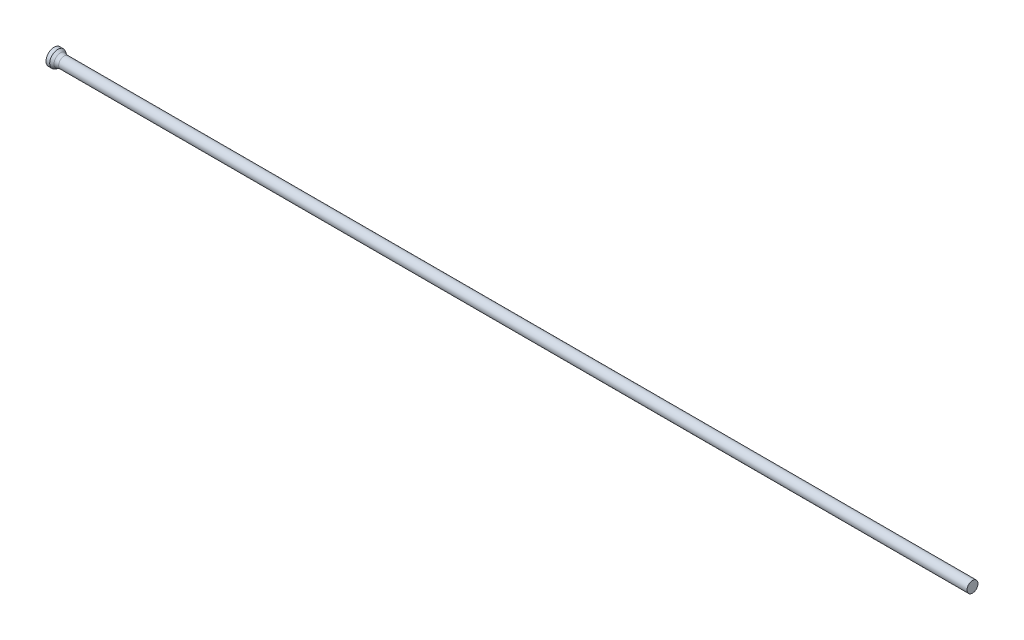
ISO-10303-21;
HEADER;
FILE_DESCRIPTION(('STEP AP214'),'2;1');
FILE_NAME('part.step','',(''),(''),'','','');
FILE_SCHEMA(('AUTOMOTIVE_DESIGN { 1 0 10303 214 1 1 1 1 }'));
ENDSEC;
DATA;
#1=APPLICATION_CONTEXT('core data for automotive mechanical design processes');
#2=APPLICATION_PROTOCOL_DEFINITION('international standard','automotive_design',2000,#1);
#3=PRODUCT_CONTEXT('',#1,'mechanical');
#4=PRODUCT('Part','Part','',(#3));
#5=PRODUCT_RELATED_PRODUCT_CATEGORY('part','',(#4));
#6=PRODUCT_DEFINITION_FORMATION('','',#4);
#7=PRODUCT_DEFINITION_CONTEXT('part definition',#1,'design');
#8=PRODUCT_DEFINITION('design','',#6,#7);
#9=PRODUCT_DEFINITION_SHAPE('','',#8);
#10=(LENGTH_UNIT() NAMED_UNIT(*) SI_UNIT(.MILLI.,.METRE.));
#11=(NAMED_UNIT(*) PLANE_ANGLE_UNIT() SI_UNIT($,.RADIAN.));
#12=(NAMED_UNIT(*) SI_UNIT($,.STERADIAN.) SOLID_ANGLE_UNIT());
#13=UNCERTAINTY_MEASURE_WITH_UNIT(LENGTH_MEASURE(1.E-05),#10,'distance_accuracy_value','');
#14=(GEOMETRIC_REPRESENTATION_CONTEXT(3) GLOBAL_UNCERTAINTY_ASSIGNED_CONTEXT((#13)) GLOBAL_UNIT_ASSIGNED_CONTEXT((#10,
#11,#12)) REPRESENTATION_CONTEXT('',''));
#15=CARTESIAN_POINT('',(0.,0.,0.));
#16=DIRECTION('',(0.,0.,1.));
#17=DIRECTION('',(1.,0.,0.));
#18=AXIS2_PLACEMENT_3D('',#15,#16,#17);
#19=CARTESIAN_POINT('',(0.,0.,0.));
#20=DIRECTION('',(1.,0.,0.));
#21=DIRECTION('',(0.,0.,-1.));
#22=AXIS2_PLACEMENT_3D('',#19,#20,#21);
#23=PLANE('',#22);
#24=CARTESIAN_POINT('',(0.,0.,0.));
#25=DIRECTION('',(-1.,0.,0.));
#26=DIRECTION('',(0.,0.,1.));
#27=AXIS2_PLACEMENT_3D('',#24,#25,#26);
#28=CIRCLE('',#27,1.1);
#29=CARTESIAN_POINT('',(0.,0.,1.1));
#30=VERTEX_POINT('',#29);
#31=EDGE_CURVE('E25',#30,#30,#28,.T.);
#32=ORIENTED_EDGE('',*,*,#31,.T.);
#33=EDGE_LOOP('',(#32));
#34=FACE_BOUND('',#33,.T.);
#35=ADVANCED_FACE('F14',(#34),#23,.F.);
#36=CARTESIAN_POINT('',(0.,0.,0.));
#37=DIRECTION('',(-1.,0.,0.));
#38=DIRECTION('',(0.,0.,1.));
#39=AXIS2_PLACEMENT_3D('',#36,#37,#38);
#40=CYLINDRICAL_SURFACE('',#39,1.1);
#41=ORIENTED_EDGE('',*,*,#31,.F.);
#42=EDGE_LOOP('',(#41));
#43=FACE_BOUND('',#42,.T.);
#44=CARTESIAN_POINT('',(0.503782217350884,0.,0.));
#45=DIRECTION('',(-1.,0.,0.));
#46=DIRECTION('',(0.,0.,1.));
#47=AXIS2_PLACEMENT_3D('',#44,#45,#46);
#48=CIRCLE('',#47,1.1);
#49=CARTESIAN_POINT('',(0.503782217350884,0.,1.1));
#50=VERTEX_POINT('',#49);
#51=EDGE_CURVE('E29',#50,#50,#48,.T.);
#52=ORIENTED_EDGE('',*,*,#51,.T.);
#53=EDGE_LOOP('',(#52));
#54=FACE_BOUND('',#53,.T.);
#55=ADVANCED_FACE('F53',(#43,#54),#40,.T.);
#56=CARTESIAN_POINT('',(1.11,0.,0.));
#57=DIRECTION('',(-1.,0.,0.));
#58=DIRECTION('',(0.,0.,1.));
#59=AXIS2_PLACEMENT_3D('',#56,#57,#58);
#60=CONICAL_SURFACE('',#59,0.75,0.523598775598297);
#61=CARTESIAN_POINT('',(0.877949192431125,0.,0.));
#62=DIRECTION('',(-1.,0.,0.));
#63=DIRECTION('',(0.,0.,1.));
#64=AXIS2_PLACEMENT_3D('',#61,#62,#63);
#65=CIRCLE('',#64,0.883974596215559);
#66=CARTESIAN_POINT('',(0.877949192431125,0.,0.883974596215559));
#67=VERTEX_POINT('',#66);
#68=EDGE_CURVE('E21',#67,#67,#65,.T.);
#69=ORIENTED_EDGE('',*,*,#68,.T.);
#70=EDGE_LOOP('',(#69));
#71=FACE_BOUND('',#70,.T.);
#72=ORIENTED_EDGE('',*,*,#51,.F.);
#73=EDGE_LOOP('',(#72));
#74=FACE_BOUND('',#73,.T.);
#75=ADVANCED_FACE('F50',(#71,#74),#60,.T.);
#76=CARTESIAN_POINT('',(0.,0.,0.));
#77=DIRECTION('',(-1.,0.,0.));
#78=DIRECTION('',(0.,0.,1.));
#79=AXIS2_PLACEMENT_3D('',#76,#77,#78);
#80=CYLINDRICAL_SURFACE('',#79,0.75);
#81=CARTESIAN_POINT('',(1.37794919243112,0.,0.));
#82=DIRECTION('',(-1.,0.,0.));
#83=DIRECTION('',(0.,0.,1.));
#84=AXIS2_PLACEMENT_3D('',#81,#82,#83);
#85=CIRCLE('',#84,0.75);
#86=CARTESIAN_POINT('',(1.37794919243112,0.,0.75));
#87=VERTEX_POINT('',#86);
#88=EDGE_CURVE('E9',#87,#87,#85,.F.);
#89=ORIENTED_EDGE('',*,*,#88,.T.);
#90=EDGE_LOOP('',(#89));
#91=FACE_BOUND('',#90,.T.);
#92=CARTESIAN_POINT('',(125.,0.,0.));
#93=DIRECTION('',(-1.,0.,0.));
#94=DIRECTION('',(0.,0.,1.));
#95=AXIS2_PLACEMENT_3D('',#92,#93,#94);
#96=CIRCLE('',#95,0.75);
#97=CARTESIAN_POINT('',(125.,0.,0.75));
#98=VERTEX_POINT('',#97);
#99=EDGE_CURVE('E34',#98,#98,#96,.T.);
#100=ORIENTED_EDGE('',*,*,#99,.T.);
#101=EDGE_LOOP('',(#100));
#102=FACE_BOUND('',#101,.T.);
#103=ADVANCED_FACE('F38',(#91,#102),#80,.T.);
#104=CARTESIAN_POINT('',(125.,0.75,0.));
#105=DIRECTION('',(-1.,0.,0.));
#106=DIRECTION('',(0.,0.,1.));
#107=AXIS2_PLACEMENT_3D('',#104,#105,#106);
#108=PLANE('',#107);
#109=ORIENTED_EDGE('',*,*,#99,.F.);
#110=EDGE_LOOP('',(#109));
#111=FACE_BOUND('',#110,.T.);
#112=ADVANCED_FACE('F40',(#111),#108,.F.);
#113=CARTESIAN_POINT('',(1.37794919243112,0.,0.));
#114=DIRECTION('',(-1.,0.,0.));
#115=DIRECTION('',(0.,0.,1.));
#116=AXIS2_PLACEMENT_3D('',#113,#114,#115);
#117=TOROIDAL_SURFACE('',#116,1.75,1.);
#118=ORIENTED_EDGE('',*,*,#88,.F.);
#119=EDGE_LOOP('',(#118));
#120=FACE_BOUND('',#119,.T.);
#121=ORIENTED_EDGE('',*,*,#68,.F.);
#122=EDGE_LOOP('',(#121));
#123=FACE_BOUND('',#122,.T.);
#124=ADVANCED_FACE('F16',(#120,#123),#117,.F.);
#125=CLOSED_SHELL('',(#35,#55,#75,#103,#112,#124));
#126=MANIFOLD_SOLID_BREP('B1',#125);
#127=ADVANCED_BREP_SHAPE_REPRESENTATION('',(#18,#126),#14);
#128=SHAPE_DEFINITION_REPRESENTATION(#9,#127);
ENDSEC;
END-ISO-10303-21;
